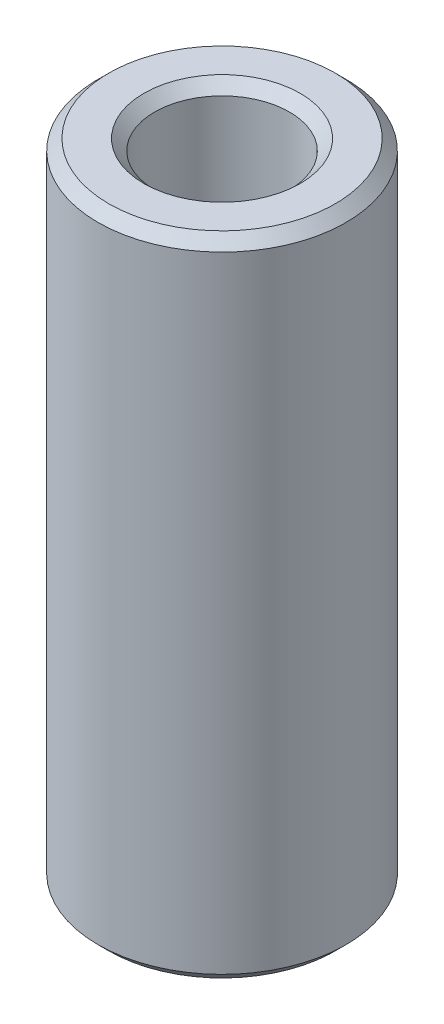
ISO-10303-21;
HEADER;
FILE_DESCRIPTION(('STEP AP214'),'2;1');
FILE_NAME('part.step','',(''),(''),'','','');
FILE_SCHEMA(('AUTOMOTIVE_DESIGN { 1 0 10303 214 1 1 1 1 }'));
ENDSEC;
DATA;
#1=APPLICATION_CONTEXT('core data for automotive mechanical design processes');
#2=APPLICATION_PROTOCOL_DEFINITION('international standard','automotive_design',2000,#1);
#3=PRODUCT_CONTEXT('',#1,'mechanical');
#4=PRODUCT('Part','Part','',(#3));
#5=PRODUCT_RELATED_PRODUCT_CATEGORY('part','',(#4));
#6=PRODUCT_DEFINITION_FORMATION('','',#4);
#7=PRODUCT_DEFINITION_CONTEXT('part definition',#1,'design');
#8=PRODUCT_DEFINITION('design','',#6,#7);
#9=PRODUCT_DEFINITION_SHAPE('','',#8);
#10=(LENGTH_UNIT() NAMED_UNIT(*) SI_UNIT(.MILLI.,.METRE.));
#11=(NAMED_UNIT(*) PLANE_ANGLE_UNIT() SI_UNIT($,.RADIAN.));
#12=(NAMED_UNIT(*) SI_UNIT($,.STERADIAN.) SOLID_ANGLE_UNIT());
#13=UNCERTAINTY_MEASURE_WITH_UNIT(LENGTH_MEASURE(1.E-05),#10,'distance_accuracy_value','');
#14=(GEOMETRIC_REPRESENTATION_CONTEXT(3) GLOBAL_UNCERTAINTY_ASSIGNED_CONTEXT((#13)) GLOBAL_UNIT_ASSIGNED_CONTEXT((#10,
#11,#12)) REPRESENTATION_CONTEXT('',''));
#15=CARTESIAN_POINT('',(0.,0.,0.));
#16=DIRECTION('',(0.,0.,1.));
#17=DIRECTION('',(1.,0.,0.));
#18=AXIS2_PLACEMENT_3D('',#15,#16,#17);
#19=CARTESIAN_POINT('',(0.,120.,0.));
#20=DIRECTION('',(0.,1.,0.));
#21=DIRECTION('',(0.,0.,1.));
#22=AXIS2_PLACEMENT_3D('',#19,#20,#21);
#23=PLANE('',#22);
#24=CARTESIAN_POINT('',(0.,120.,0.));
#25=DIRECTION('',(0.,1.,0.));
#26=DIRECTION('',(0.,0.,1.));
#27=AXIS2_PLACEMENT_3D('',#24,#25,#26);
#28=CIRCLE('',#27,14.5);
#29=CARTESIAN_POINT('',(0.,120.,14.5));
#30=VERTEX_POINT('',#29);
#31=EDGE_CURVE('E42',#30,#30,#28,.F.);
#32=ORIENTED_EDGE('',*,*,#31,.T.);
#33=EDGE_LOOP('',(#32));
#34=FACE_BOUND('',#33,.T.);
#35=CARTESIAN_POINT('',(0.,120.,0.));
#36=DIRECTION('',(0.,1.,0.));
#37=DIRECTION('',(0.,0.,1.));
#38=AXIS2_PLACEMENT_3D('',#35,#36,#37);
#39=CIRCLE('',#38,21.);
#40=CARTESIAN_POINT('',(0.,120.,21.));
#41=VERTEX_POINT('',#40);
#42=EDGE_CURVE('E46',#41,#41,#39,.T.);
#43=ORIENTED_EDGE('',*,*,#42,.T.);
#44=EDGE_LOOP('',(#43));
#45=FACE_BOUND('',#44,.T.);
#46=ADVANCED_FACE('F31',(#34,#45),#23,.T.);
#47=CARTESIAN_POINT('',(0.,0.,0.));
#48=DIRECTION('',(0.,1.,0.));
#49=DIRECTION('',(0.,0.,1.));
#50=AXIS2_PLACEMENT_3D('',#47,#48,#49);
#51=PLANE('',#50);
#52=CARTESIAN_POINT('',(0.,0.,0.));
#53=DIRECTION('',(0.,1.,0.));
#54=DIRECTION('',(0.,0.,1.));
#55=AXIS2_PLACEMENT_3D('',#52,#53,#54);
#56=CIRCLE('',#55,14.5);
#57=CARTESIAN_POINT('',(0.,0.,14.5));
#58=VERTEX_POINT('',#57);
#59=EDGE_CURVE('E57',#58,#58,#56,.T.);
#60=ORIENTED_EDGE('',*,*,#59,.T.);
#61=EDGE_LOOP('',(#60));
#62=FACE_BOUND('',#61,.T.);
#63=CARTESIAN_POINT('',(0.,0.,0.));
#64=DIRECTION('',(0.,1.,0.));
#65=DIRECTION('',(0.,0.,1.));
#66=AXIS2_PLACEMENT_3D('',#63,#64,#65);
#67=CIRCLE('',#66,21.);
#68=CARTESIAN_POINT('',(0.,0.,21.));
#69=VERTEX_POINT('',#68);
#70=EDGE_CURVE('E60',#69,#69,#67,.F.);
#71=ORIENTED_EDGE('',*,*,#70,.T.);
#72=EDGE_LOOP('',(#71));
#73=FACE_BOUND('',#72,.T.);
#74=ADVANCED_FACE('F64',(#62,#73),#51,.F.);
#75=CARTESIAN_POINT('',(0.,120.,0.));
#76=DIRECTION('',(0.,-1.,0.));
#77=DIRECTION('',(0.,0.,-1.));
#78=AXIS2_PLACEMENT_3D('',#75,#76,#77);
#79=CYLINDRICAL_SURFACE('',#78,23.);
#80=CARTESIAN_POINT('',(0.,2.,0.));
#81=DIRECTION('',(0.,1.,0.));
#82=DIRECTION('',(0.,0.,1.));
#83=AXIS2_PLACEMENT_3D('',#80,#81,#82);
#84=CIRCLE('',#83,23.);
#85=CARTESIAN_POINT('',(0.,2.,23.));
#86=VERTEX_POINT('',#85);
#87=EDGE_CURVE('E10',#86,#86,#84,.T.);
#88=ORIENTED_EDGE('',*,*,#87,.T.);
#89=EDGE_LOOP('',(#88));
#90=FACE_BOUND('',#89,.T.);
#91=CARTESIAN_POINT('',(0.,118.,0.));
#92=DIRECTION('',(0.,1.,0.));
#93=DIRECTION('',(0.,0.,1.));
#94=AXIS2_PLACEMENT_3D('',#91,#92,#93);
#95=CIRCLE('',#94,23.);
#96=CARTESIAN_POINT('',(0.,118.,23.));
#97=VERTEX_POINT('',#96);
#98=EDGE_CURVE('E38',#97,#97,#95,.F.);
#99=ORIENTED_EDGE('',*,*,#98,.T.);
#100=EDGE_LOOP('',(#99));
#101=FACE_BOUND('',#100,.T.);
#102=ADVANCED_FACE('F33',(#90,#101),#79,.T.);
#103=CARTESIAN_POINT('',(0.,120.,0.));
#104=DIRECTION('',(0.,-1.,0.));
#105=DIRECTION('',(0.,0.,-1.));
#106=AXIS2_PLACEMENT_3D('',#103,#104,#105);
#107=CYLINDRICAL_SURFACE('',#106,12.5);
#108=CARTESIAN_POINT('',(0.,2.00000000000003,0.));
#109=DIRECTION('',(0.,1.,0.));
#110=DIRECTION('',(0.,0.,1.));
#111=AXIS2_PLACEMENT_3D('',#108,#109,#110);
#112=CIRCLE('',#111,12.5);
#113=CARTESIAN_POINT('',(0.,2.00000000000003,12.5));
#114=VERTEX_POINT('',#113);
#115=EDGE_CURVE('E51',#114,#114,#112,.F.);
#116=ORIENTED_EDGE('',*,*,#115,.T.);
#117=EDGE_LOOP('',(#116));
#118=FACE_BOUND('',#117,.T.);
#119=CARTESIAN_POINT('',(0.,118.,0.));
#120=DIRECTION('',(0.,1.,0.));
#121=DIRECTION('',(0.,0.,1.));
#122=AXIS2_PLACEMENT_3D('',#119,#120,#121);
#123=CIRCLE('',#122,12.5);
#124=CARTESIAN_POINT('',(0.,118.,12.5));
#125=VERTEX_POINT('',#124);
#126=EDGE_CURVE('E54',#125,#125,#123,.T.);
#127=ORIENTED_EDGE('',*,*,#126,.T.);
#128=EDGE_LOOP('',(#127));
#129=FACE_BOUND('',#128,.T.);
#130=ADVANCED_FACE('F90',(#118,#129),#107,.F.);
#131=CARTESIAN_POINT('',(0.,0.,0.));
#132=DIRECTION('',(0.,-1.,0.));
#133=DIRECTION('',(0.,0.,-1.));
#134=AXIS2_PLACEMENT_3D('',#131,#132,#133);
#135=CONICAL_SURFACE('',#134,14.5,0.785398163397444);
#136=ORIENTED_EDGE('',*,*,#115,.F.);
#137=EDGE_LOOP('',(#136));
#138=FACE_BOUND('',#137,.T.);
#139=ORIENTED_EDGE('',*,*,#59,.F.);
#140=EDGE_LOOP('',(#139));
#141=FACE_BOUND('',#140,.T.);
#142=ADVANCED_FACE('F78',(#138,#141),#135,.F.);
#143=CARTESIAN_POINT('',(0.,118.,0.));
#144=DIRECTION('',(0.,1.,0.));
#145=DIRECTION('',(0.,0.,1.));
#146=AXIS2_PLACEMENT_3D('',#143,#144,#145);
#147=CONICAL_SURFACE('',#146,12.5,0.785398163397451);
#148=ORIENTED_EDGE('',*,*,#31,.F.);
#149=EDGE_LOOP('',(#148));
#150=FACE_BOUND('',#149,.T.);
#151=ORIENTED_EDGE('',*,*,#126,.F.);
#152=EDGE_LOOP('',(#151));
#153=FACE_BOUND('',#152,.T.);
#154=ADVANCED_FACE('F70',(#150,#153),#147,.F.);
#155=CARTESIAN_POINT('',(0.,2.,0.));
#156=DIRECTION('',(0.,1.,0.));
#157=DIRECTION('',(0.,0.,1.));
#158=AXIS2_PLACEMENT_3D('',#155,#156,#157);
#159=CONICAL_SURFACE('',#158,23.,0.78539816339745);
#160=ORIENTED_EDGE('',*,*,#70,.F.);
#161=EDGE_LOOP('',(#160));
#162=FACE_BOUND('',#161,.T.);
#163=ORIENTED_EDGE('',*,*,#87,.F.);
#164=EDGE_LOOP('',(#163));
#165=FACE_BOUND('',#164,.T.);
#166=ADVANCED_FACE('F66',(#162,#165),#159,.T.);
#167=CARTESIAN_POINT('',(0.,120.,0.));
#168=DIRECTION('',(0.,-1.,0.));
#169=DIRECTION('',(0.,0.,-1.));
#170=AXIS2_PLACEMENT_3D('',#167,#168,#169);
#171=CONICAL_SURFACE('',#170,21.,0.785398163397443);
#172=ORIENTED_EDGE('',*,*,#98,.F.);
#173=EDGE_LOOP('',(#172));
#174=FACE_BOUND('',#173,.T.);
#175=ORIENTED_EDGE('',*,*,#42,.F.);
#176=EDGE_LOOP('',(#175));
#177=FACE_BOUND('',#176,.T.);
#178=ADVANCED_FACE('F69',(#174,#177),#171,.T.);
#179=CLOSED_SHELL('',(#46,#74,#102,#130,#142,#154,#166,#178));
#180=MANIFOLD_SOLID_BREP('B2',#179);
#181=ADVANCED_BREP_SHAPE_REPRESENTATION('',(#18,#180),#14);
#182=SHAPE_DEFINITION_REPRESENTATION(#9,#181);
ENDSEC;
END-ISO-10303-21;
